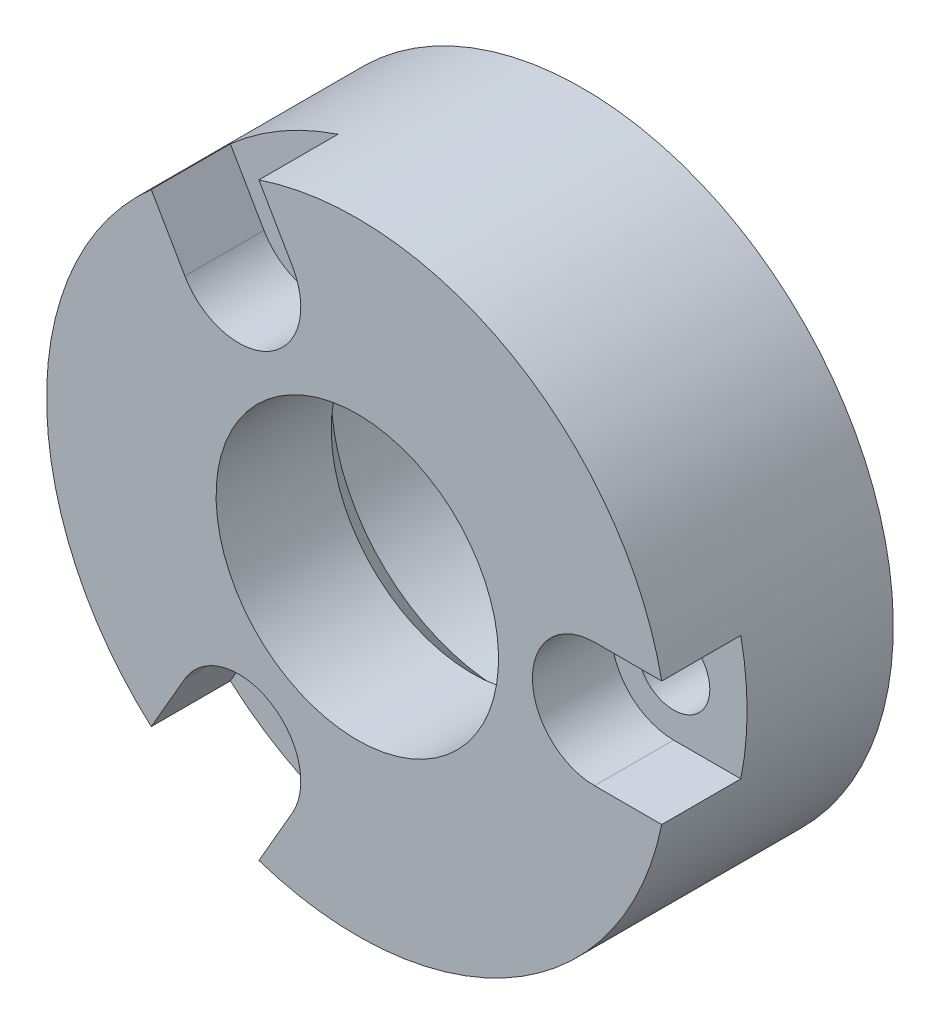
ISO-10303-21;
HEADER;
FILE_DESCRIPTION(('STEP AP214'),'2;1');
FILE_NAME('part.step','',(''),(''),'','','');
FILE_SCHEMA(('AUTOMOTIVE_DESIGN { 1 0 10303 214 1 1 1 1 }'));
ENDSEC;
DATA;
#1=APPLICATION_CONTEXT('core data for automotive mechanical design processes');
#2=APPLICATION_PROTOCOL_DEFINITION('international standard','automotive_design',2000,#1);
#3=PRODUCT_CONTEXT('',#1,'mechanical');
#4=PRODUCT('Part','Part','',(#3));
#5=PRODUCT_RELATED_PRODUCT_CATEGORY('part','',(#4));
#6=PRODUCT_DEFINITION_FORMATION('','',#4);
#7=PRODUCT_DEFINITION_CONTEXT('part definition',#1,'design');
#8=PRODUCT_DEFINITION('design','',#6,#7);
#9=PRODUCT_DEFINITION_SHAPE('','',#8);
#10=(LENGTH_UNIT() NAMED_UNIT(*) SI_UNIT(.MILLI.,.METRE.));
#11=(NAMED_UNIT(*) PLANE_ANGLE_UNIT() SI_UNIT($,.RADIAN.));
#12=(NAMED_UNIT(*) SI_UNIT($,.STERADIAN.) SOLID_ANGLE_UNIT());
#13=UNCERTAINTY_MEASURE_WITH_UNIT(LENGTH_MEASURE(1.E-05),#10,'distance_accuracy_value','');
#14=(GEOMETRIC_REPRESENTATION_CONTEXT(3) GLOBAL_UNCERTAINTY_ASSIGNED_CONTEXT((#13)) GLOBAL_UNIT_ASSIGNED_CONTEXT((#10,
#11,#12)) REPRESENTATION_CONTEXT('',''));
#15=CARTESIAN_POINT('',(0.,0.,0.));
#16=DIRECTION('',(0.,0.,1.));
#17=DIRECTION('',(1.,0.,0.));
#18=AXIS2_PLACEMENT_3D('',#15,#16,#17);
#19=CARTESIAN_POINT('',(0.,0.,40.));
#20=DIRECTION('',(0.,0.,1.));
#21=DIRECTION('',(0.499999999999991,0.866025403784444,0.));
#22=AXIS2_PLACEMENT_3D('',#19,#20,#21);
#23=CYLINDRICAL_SURFACE('',#22,27.5);
#24=CARTESIAN_POINT('',(0.,0.,19.94));
#25=DIRECTION('',(0.,0.,1.));
#26=DIRECTION('',(0.499999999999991,0.866025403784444,0.));
#27=AXIS2_PLACEMENT_3D('',#24,#25,#26);
#28=CIRCLE('',#27,27.5);
#29=CARTESIAN_POINT('',(-8.70905386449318,-26.0845237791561,19.94));
#30=VERTEX_POINT('',#29);
#31=CARTESIAN_POINT('',(26.944387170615,-5.5,19.94));
#32=VERTEX_POINT('',#31);
#33=EDGE_CURVE('E196',#30,#32,#28,.T.);
#34=ORIENTED_EDGE('',*,*,#33,.F.);
#35=DIRECTION('',(0.,0.,1.));
#36=VECTOR('',#35,1.);
#37=CARTESIAN_POINT('',(-8.70905386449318,-26.0845237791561,40.));
#38=LINE('',#37,#36);
#39=CARTESIAN_POINT('',(-8.70905386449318,-26.0845237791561,12.94));
#40=VERTEX_POINT('',#39);
#41=EDGE_CURVE('E135',#30,#40,#38,.F.);
#42=ORIENTED_EDGE('',*,*,#41,.T.);
#43=CARTESIAN_POINT('',(0.,0.,12.94));
#44=DIRECTION('',(0.,0.,1.));
#45=DIRECTION('',(1.,0.,0.));
#46=AXIS2_PLACEMENT_3D('',#43,#44,#45);
#47=CIRCLE('',#46,27.5);
#48=CARTESIAN_POINT('',(-18.235333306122,-20.584523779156,12.94));
#49=VERTEX_POINT('',#48);
#50=EDGE_CURVE('E9',#49,#40,#47,.T.);
#51=ORIENTED_EDGE('',*,*,#50,.F.);
#52=DIRECTION('',(0.,0.,1.));
#53=VECTOR('',#52,1.);
#54=CARTESIAN_POINT('',(-18.235333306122,-20.584523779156,40.));
#55=LINE('',#54,#53);
#56=CARTESIAN_POINT('',(-18.235333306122,-20.584523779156,19.94));
#57=VERTEX_POINT('',#56);
#58=EDGE_CURVE('E116',#49,#57,#55,.T.);
#59=ORIENTED_EDGE('',*,*,#58,.T.);
#60=CARTESIAN_POINT('',(-18.235333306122,20.584523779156,19.94));
#61=VERTEX_POINT('',#60);
#62=EDGE_CURVE('E201',#61,#57,#28,.T.);
#63=ORIENTED_EDGE('',*,*,#62,.F.);
#64=DIRECTION('',(0.,0.,1.));
#65=VECTOR('',#64,1.);
#66=CARTESIAN_POINT('',(-18.235333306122,20.584523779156,40.));
#67=LINE('',#66,#65);
#68=CARTESIAN_POINT('',(-18.235333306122,20.584523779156,12.94));
#69=VERTEX_POINT('',#68);
#70=EDGE_CURVE('E156',#61,#69,#67,.F.);
#71=ORIENTED_EDGE('',*,*,#70,.T.);
#72=CARTESIAN_POINT('',(0.,0.,12.94));
#73=DIRECTION('',(0.,0.,1.));
#74=DIRECTION('',(1.,0.,0.));
#75=AXIS2_PLACEMENT_3D('',#72,#73,#74);
#76=CIRCLE('',#75,27.5);
#77=CARTESIAN_POINT('',(-8.70905386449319,26.0845237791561,12.94));
#78=VERTEX_POINT('',#77);
#79=EDGE_CURVE('E212',#78,#69,#76,.T.);
#80=ORIENTED_EDGE('',*,*,#79,.F.);
#81=DIRECTION('',(0.,0.,1.));
#82=VECTOR('',#81,1.);
#83=CARTESIAN_POINT('',(-8.70905386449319,26.0845237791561,40.));
#84=LINE('',#83,#82);
#85=CARTESIAN_POINT('',(-8.70905386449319,26.0845237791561,19.94));
#86=VERTEX_POINT('',#85);
#87=EDGE_CURVE('E152',#78,#86,#84,.T.);
#88=ORIENTED_EDGE('',*,*,#87,.T.);
#89=CARTESIAN_POINT('',(26.944387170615,5.5,19.94));
#90=VERTEX_POINT('',#89);
#91=EDGE_CURVE('E197',#90,#86,#28,.T.);
#92=ORIENTED_EDGE('',*,*,#91,.F.);
#93=DIRECTION('',(0.,0.,1.));
#94=VECTOR('',#93,1.);
#95=CARTESIAN_POINT('',(26.944387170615,5.5,40.));
#96=LINE('',#95,#94);
#97=CARTESIAN_POINT('',(26.944387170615,5.5,12.94));
#98=VERTEX_POINT('',#97);
#99=EDGE_CURVE('E181',#90,#98,#96,.F.);
#100=ORIENTED_EDGE('',*,*,#99,.T.);
#101=CARTESIAN_POINT('',(0.,0.,12.94));
#102=DIRECTION('',(0.,0.,1.));
#103=DIRECTION('',(1.,0.,0.));
#104=AXIS2_PLACEMENT_3D('',#101,#102,#103);
#105=CIRCLE('',#104,27.5);
#106=CARTESIAN_POINT('',(26.944387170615,-5.5,12.94));
#107=VERTEX_POINT('',#106);
#108=EDGE_CURVE('E207',#107,#98,#105,.T.);
#109=ORIENTED_EDGE('',*,*,#108,.F.);
#110=DIRECTION('',(0.,0.,1.));
#111=VECTOR('',#110,1.);
#112=CARTESIAN_POINT('',(26.944387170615,-5.5,40.));
#113=LINE('',#112,#111);
#114=EDGE_CURVE('E176',#107,#32,#113,.T.);
#115=ORIENTED_EDGE('',*,*,#114,.T.);
#116=EDGE_LOOP('',(#34,#42,#51,#59,#63,#71,#80,#88,#92,#100,#109,#115));
#117=FACE_BOUND('',#116,.T.);
#118=CARTESIAN_POINT('',(0.,0.,0.));
#119=DIRECTION('',(0.,0.,1.));
#120=DIRECTION('',(0.499999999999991,0.866025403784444,0.));
#121=AXIS2_PLACEMENT_3D('',#118,#119,#120);
#122=CIRCLE('',#121,27.5);
#123=CARTESIAN_POINT('',(13.7499999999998,23.8156986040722,0.));
#124=VERTEX_POINT('',#123);
#125=EDGE_CURVE('E200',#124,#124,#122,.T.);
#126=ORIENTED_EDGE('',*,*,#125,.T.);
#127=EDGE_LOOP('',(#126));
#128=FACE_BOUND('',#127,.T.);
#129=ADVANCED_FACE('F14',(#117,#128),#23,.T.);
#130=CARTESIAN_POINT('',(-23.8156986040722,13.7499999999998,19.94));
#131=DIRECTION('',(0.,0.,-1.));
#132=DIRECTION('',(-0.499999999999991,-0.866025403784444,0.));
#133=AXIS2_PLACEMENT_3D('',#130,#131,#132);
#134=PLANE('',#133);
#135=CARTESIAN_POINT('',(-10.5,-18.1865334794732,19.94));
#136=DIRECTION('',(0.,0.,1.));
#137=DIRECTION('',(1.,0.,0.));
#138=AXIS2_PLACEMENT_3D('',#135,#136,#137);
#139=CIRCLE('',#138,5.5);
#140=CARTESIAN_POINT('',(-5.73686027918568,-20.9365334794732,19.94));
#141=VERTEX_POINT('',#140);
#142=CARTESIAN_POINT('',(-15.2631397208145,-15.4365334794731,19.94));
#143=VERTEX_POINT('',#142);
#144=EDGE_CURVE('E29',#141,#143,#139,.T.);
#145=ORIENTED_EDGE('',*,*,#144,.F.);
#146=DIRECTION('',(-0.5,-0.866025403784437,0.));
#147=VECTOR('',#146,1.);
#148=CARTESIAN_POINT('',(4.76313972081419,-2.75000000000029,19.94));
#149=LINE('',#148,#147);
#150=EDGE_CURVE('E22',#141,#30,#149,.T.);
#151=ORIENTED_EDGE('',*,*,#150,.T.);
#152=ORIENTED_EDGE('',*,*,#33,.T.);
#153=DIRECTION('',(1.,0.,0.));
#154=VECTOR('',#153,1.);
#155=CARTESIAN_POINT('',(39.8234844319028,-5.5,19.94));
#156=LINE('',#155,#154);
#157=CARTESIAN_POINT('',(21.,-5.5,19.94));
#158=VERTEX_POINT('',#157);
#159=EDGE_CURVE('E164',#158,#32,#156,.T.);
#160=ORIENTED_EDGE('',*,*,#159,.F.);
#161=CARTESIAN_POINT('',(21.,0.,19.94));
#162=DIRECTION('',(0.,0.,1.));
#163=DIRECTION('',(1.,0.,0.));
#164=AXIS2_PLACEMENT_3D('',#161,#162,#163);
#165=CIRCLE('',#164,5.5);
#166=CARTESIAN_POINT('',(21.,5.5,19.94));
#167=VERTEX_POINT('',#166);
#168=EDGE_CURVE('E159',#167,#158,#165,.T.);
#169=ORIENTED_EDGE('',*,*,#168,.F.);
#170=DIRECTION('',(1.,0.,0.));
#171=VECTOR('',#170,1.);
#172=CARTESIAN_POINT('',(-23.8156986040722,5.5,19.94));
#173=LINE('',#172,#171);
#174=EDGE_CURVE('E204',#167,#90,#173,.T.);
#175=ORIENTED_EDGE('',*,*,#174,.T.);
#176=ORIENTED_EDGE('',*,*,#91,.T.);
#177=DIRECTION('',(-0.5,0.866025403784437,0.));
#178=VECTOR('',#177,1.);
#179=CARTESIAN_POINT('',(-5.73686027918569,20.9365334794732,19.94));
#180=LINE('',#179,#178);
#181=CARTESIAN_POINT('',(-5.73686027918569,20.9365334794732,19.94));
#182=VERTEX_POINT('',#181);
#183=EDGE_CURVE('E142',#182,#86,#180,.T.);
#184=ORIENTED_EDGE('',*,*,#183,.F.);
#185=CARTESIAN_POINT('',(-10.5,18.1865334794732,19.94));
#186=DIRECTION('',(0.,0.,1.));
#187=DIRECTION('',(1.,0.,0.));
#188=AXIS2_PLACEMENT_3D('',#185,#186,#187);
#189=CIRCLE('',#188,5.5);
#190=CARTESIAN_POINT('',(-15.2631397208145,15.4365334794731,19.94));
#191=VERTEX_POINT('',#190);
#192=EDGE_CURVE('E37',#191,#182,#189,.T.);
#193=ORIENTED_EDGE('',*,*,#192,.F.);
#194=DIRECTION('',(-0.5,0.866025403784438,0.));
#195=VECTOR('',#194,1.);
#196=CARTESIAN_POINT('',(-16.6709890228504,17.875,19.94));
#197=LINE('',#196,#195);
#198=EDGE_CURVE('E209',#191,#61,#197,.T.);
#199=ORIENTED_EDGE('',*,*,#198,.T.);
#200=ORIENTED_EDGE('',*,*,#62,.T.);
#201=DIRECTION('',(-0.5,-0.866025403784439,0.));
#202=VECTOR('',#201,1.);
#203=CARTESIAN_POINT('',(-15.2631397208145,-15.4365334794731,19.94));
#204=LINE('',#203,#202);
#205=EDGE_CURVE('E123',#143,#57,#204,.T.);
#206=ORIENTED_EDGE('',*,*,#205,.F.);
#207=EDGE_LOOP('',(#145,#151,#152,#160,#169,#175,#176,#184,#193,#199,#200,#206));
#208=FACE_BOUND('',#207,.T.);
#209=CARTESIAN_POINT('',(0.,0.,19.94));
#210=DIRECTION('',(0.,0.,1.));
#211=DIRECTION('',(0.499999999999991,0.866025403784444,0.));
#212=AXIS2_PLACEMENT_3D('',#209,#210,#211);
#213=CIRCLE('',#212,12.5);
#214=CARTESIAN_POINT('',(6.24999999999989,10.8253175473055,19.94));
#215=VERTEX_POINT('',#214);
#216=EDGE_CURVE('E193',#215,#215,#213,.T.);
#217=ORIENTED_EDGE('',*,*,#216,.F.);
#218=EDGE_LOOP('',(#217));
#219=FACE_BOUND('',#218,.T.);
#220=ADVANCED_FACE('F216',(#208,#219),#134,.F.);
#221=CARTESIAN_POINT('',(-13.1635861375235,7.59999999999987,0.));
#222=DIRECTION('',(0.,0.,1.));
#223=DIRECTION('',(0.499999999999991,0.866025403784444,0.));
#224=AXIS2_PLACEMENT_3D('',#221,#222,#223);
#225=PLANE('',#224);
#226=CARTESIAN_POINT('',(-10.5,18.1865334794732,0.));
#227=DIRECTION('',(0.,0.,1.));
#228=DIRECTION('',(1.,0.,0.));
#229=AXIS2_PLACEMENT_3D('',#226,#227,#228);
#230=CIRCLE('',#229,3.2);
#231=CARTESIAN_POINT('',(-7.3,18.1865334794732,0.));
#232=VERTEX_POINT('',#231);
#233=EDGE_CURVE('E310',#232,#232,#230,.T.);
#234=ORIENTED_EDGE('',*,*,#233,.T.);
#235=EDGE_LOOP('',(#234));
#236=FACE_BOUND('',#235,.T.);
#237=CARTESIAN_POINT('',(-10.5,-18.1865334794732,0.));
#238=DIRECTION('',(0.,0.,1.));
#239=DIRECTION('',(1.,0.,0.));
#240=AXIS2_PLACEMENT_3D('',#237,#238,#239);
#241=CIRCLE('',#240,3.2);
#242=CARTESIAN_POINT('',(-7.3,-18.1865334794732,0.));
#243=VERTEX_POINT('',#242);
#244=EDGE_CURVE('E318',#243,#243,#241,.T.);
#245=ORIENTED_EDGE('',*,*,#244,.T.);
#246=EDGE_LOOP('',(#245));
#247=FACE_BOUND('',#246,.T.);
#248=CARTESIAN_POINT('',(21.,0.,0.));
#249=DIRECTION('',(0.,0.,1.));
#250=DIRECTION('',(1.,0.,0.));
#251=AXIS2_PLACEMENT_3D('',#248,#249,#250);
#252=CIRCLE('',#251,3.2);
#253=CARTESIAN_POINT('',(24.2,0.,0.));
#254=VERTEX_POINT('',#253);
#255=EDGE_CURVE('E131',#254,#254,#252,.T.);
#256=ORIENTED_EDGE('',*,*,#255,.T.);
#257=EDGE_LOOP('',(#256));
#258=FACE_BOUND('',#257,.T.);
#259=ORIENTED_EDGE('',*,*,#125,.F.);
#260=EDGE_LOOP('',(#259));
#261=FACE_BOUND('',#260,.T.);
#262=CARTESIAN_POINT('',(0.,0.,0.));
#263=DIRECTION('',(0.,0.,1.));
#264=DIRECTION('',(0.499999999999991,0.866025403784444,0.));
#265=AXIS2_PLACEMENT_3D('',#262,#263,#264);
#266=CIRCLE('',#265,15.2);
#267=CARTESIAN_POINT('',(7.59999999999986,13.1635861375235,0.));
#268=VERTEX_POINT('',#267);
#269=EDGE_CURVE('E184',#268,#268,#266,.T.);
#270=ORIENTED_EDGE('',*,*,#269,.T.);
#271=EDGE_LOOP('',(#270));
#272=FACE_BOUND('',#271,.T.);
#273=ADVANCED_FACE('F16',(#236,#247,#258,#261,#272),#225,.F.);
#274=CARTESIAN_POINT('',(0.,0.,40.));
#275=DIRECTION('',(0.,0.,1.));
#276=DIRECTION('',(0.499999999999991,0.866025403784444,0.));
#277=AXIS2_PLACEMENT_3D('',#274,#275,#276);
#278=CYLINDRICAL_SURFACE('',#277,12.5);
#279=CARTESIAN_POINT('',(0.,0.,9.75));
#280=DIRECTION('',(0.,0.,1.));
#281=DIRECTION('',(0.499999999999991,0.866025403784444,0.));
#282=AXIS2_PLACEMENT_3D('',#279,#280,#281);
#283=CIRCLE('',#282,12.5);
#284=CARTESIAN_POINT('',(6.24999999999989,10.8253175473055,9.75));
#285=VERTEX_POINT('',#284);
#286=EDGE_CURVE('E190',#285,#285,#283,.T.);
#287=ORIENTED_EDGE('',*,*,#286,.F.);
#288=EDGE_LOOP('',(#287));
#289=FACE_BOUND('',#288,.T.);
#290=ORIENTED_EDGE('',*,*,#216,.T.);
#291=EDGE_LOOP('',(#290));
#292=FACE_BOUND('',#291,.T.);
#293=ADVANCED_FACE('F244',(#289,#292),#278,.F.);
#294=CARTESIAN_POINT('',(0.,0.,9.75));
#295=DIRECTION('',(0.,0.,-1.));
#296=DIRECTION('',(-0.499999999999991,-0.866025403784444,0.));
#297=AXIS2_PLACEMENT_3D('',#294,#295,#296);
#298=CONICAL_SURFACE('',#297,12.5,0.785398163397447);
#299=CARTESIAN_POINT('',(0.,0.,7.05));
#300=DIRECTION('',(0.,0.,1.));
#301=DIRECTION('',(0.499999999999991,0.866025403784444,0.));
#302=AXIS2_PLACEMENT_3D('',#299,#300,#301);
#303=CIRCLE('',#302,15.2);
#304=CARTESIAN_POINT('',(7.59999999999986,13.1635861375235,7.05));
#305=VERTEX_POINT('',#304);
#306=EDGE_CURVE('E187',#305,#305,#303,.T.);
#307=ORIENTED_EDGE('',*,*,#306,.F.);
#308=EDGE_LOOP('',(#307));
#309=FACE_BOUND('',#308,.T.);
#310=ORIENTED_EDGE('',*,*,#286,.T.);
#311=EDGE_LOOP('',(#310));
#312=FACE_BOUND('',#311,.T.);
#313=ADVANCED_FACE('F247',(#309,#312),#298,.F.);
#314=CARTESIAN_POINT('',(0.,0.,40.));
#315=DIRECTION('',(0.,0.,1.));
#316=DIRECTION('',(0.499999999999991,0.866025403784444,0.));
#317=AXIS2_PLACEMENT_3D('',#314,#315,#316);
#318=CYLINDRICAL_SURFACE('',#317,15.2);
#319=ORIENTED_EDGE('',*,*,#269,.F.);
#320=EDGE_LOOP('',(#319));
#321=FACE_BOUND('',#320,.T.);
#322=ORIENTED_EDGE('',*,*,#306,.T.);
#323=EDGE_LOOP('',(#322));
#324=FACE_BOUND('',#323,.T.);
#325=ADVANCED_FACE('F251',(#321,#324),#318,.F.);
#326=CARTESIAN_POINT('',(21.,0.,12.94));
#327=DIRECTION('',(0.,0.,1.));
#328=DIRECTION('',(1.,0.,0.));
#329=AXIS2_PLACEMENT_3D('',#326,#327,#328);
#330=PLANE('',#329);
#331=CARTESIAN_POINT('',(21.,0.,12.94));
#332=DIRECTION('',(0.,0.,1.));
#333=DIRECTION('',(1.,0.,0.));
#334=AXIS2_PLACEMENT_3D('',#331,#332,#333);
#335=CIRCLE('',#334,3.2);
#336=CARTESIAN_POINT('',(24.2,0.,12.94));
#337=VERTEX_POINT('',#336);
#338=EDGE_CURVE('E127',#337,#337,#335,.T.);
#339=ORIENTED_EDGE('',*,*,#338,.F.);
#340=EDGE_LOOP('',(#339));
#341=FACE_BOUND('',#340,.T.);
#342=ORIENTED_EDGE('',*,*,#108,.T.);
#343=DIRECTION('',(-1.,0.,0.));
#344=VECTOR('',#343,1.);
#345=CARTESIAN_POINT('',(21.,5.5,12.94));
#346=LINE('',#345,#344);
#347=CARTESIAN_POINT('',(21.,5.5,12.94));
#348=VERTEX_POINT('',#347);
#349=EDGE_CURVE('E167',#98,#348,#346,.T.);
#350=ORIENTED_EDGE('',*,*,#349,.T.);
#351=CARTESIAN_POINT('',(21.,0.,12.94));
#352=DIRECTION('',(0.,0.,1.));
#353=DIRECTION('',(1.,0.,0.));
#354=AXIS2_PLACEMENT_3D('',#351,#352,#353);
#355=CIRCLE('',#354,5.5);
#356=CARTESIAN_POINT('',(21.,-5.5,12.94));
#357=VERTEX_POINT('',#356);
#358=EDGE_CURVE('E160',#348,#357,#355,.T.);
#359=ORIENTED_EDGE('',*,*,#358,.T.);
#360=DIRECTION('',(1.,0.,0.));
#361=VECTOR('',#360,1.);
#362=CARTESIAN_POINT('',(39.8234844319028,-5.5,12.94));
#363=LINE('',#362,#361);
#364=EDGE_CURVE('E163',#357,#107,#363,.T.);
#365=ORIENTED_EDGE('',*,*,#364,.T.);
#366=EDGE_LOOP('',(#342,#350,#359,#365));
#367=FACE_BOUND('',#366,.T.);
#368=ADVANCED_FACE('F255',(#341,#367),#330,.T.);
#369=CARTESIAN_POINT('',(21.,5.5,12.94));
#370=DIRECTION('',(0.,1.,0.));
#371=DIRECTION('',(0.,0.,1.));
#372=AXIS2_PLACEMENT_3D('',#369,#370,#371);
#373=PLANE('',#372);
#374=ORIENTED_EDGE('',*,*,#174,.F.);
#375=DIRECTION('',(0.,0.,1.));
#376=VECTOR('',#375,1.);
#377=CARTESIAN_POINT('',(21.,5.5,12.94));
#378=LINE('',#377,#376);
#379=EDGE_CURVE('E173',#348,#167,#378,.T.);
#380=ORIENTED_EDGE('',*,*,#379,.F.);
#381=ORIENTED_EDGE('',*,*,#349,.F.);
#382=ORIENTED_EDGE('',*,*,#99,.F.);
#383=EDGE_LOOP('',(#374,#380,#381,#382));
#384=FACE_BOUND('',#383,.T.);
#385=ADVANCED_FACE('F265',(#384),#373,.F.);
#386=CARTESIAN_POINT('',(39.8234844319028,-5.5,12.94));
#387=DIRECTION('',(0.,-1.,0.));
#388=DIRECTION('',(0.,0.,-1.));
#389=AXIS2_PLACEMENT_3D('',#386,#387,#388);
#390=PLANE('',#389);
#391=ORIENTED_EDGE('',*,*,#364,.F.);
#392=DIRECTION('',(0.,0.,1.));
#393=VECTOR('',#392,1.);
#394=CARTESIAN_POINT('',(21.,-5.5,12.94));
#395=LINE('',#394,#393);
#396=EDGE_CURVE('E169',#357,#158,#395,.T.);
#397=ORIENTED_EDGE('',*,*,#396,.T.);
#398=ORIENTED_EDGE('',*,*,#159,.T.);
#399=ORIENTED_EDGE('',*,*,#114,.F.);
#400=EDGE_LOOP('',(#391,#397,#398,#399));
#401=FACE_BOUND('',#400,.T.);
#402=ADVANCED_FACE('F261',(#401),#390,.F.);
#403=CARTESIAN_POINT('',(21.,0.,12.94));
#404=DIRECTION('',(0.,0.,1.));
#405=DIRECTION('',(1.,0.,0.));
#406=AXIS2_PLACEMENT_3D('',#403,#404,#405);
#407=CYLINDRICAL_SURFACE('',#406,5.5);
#408=ORIENTED_EDGE('',*,*,#168,.T.);
#409=ORIENTED_EDGE('',*,*,#396,.F.);
#410=ORIENTED_EDGE('',*,*,#358,.F.);
#411=ORIENTED_EDGE('',*,*,#379,.T.);
#412=EDGE_LOOP('',(#408,#409,#410,#411));
#413=FACE_BOUND('',#412,.T.);
#414=ADVANCED_FACE('F257',(#413),#407,.F.);
#415=CARTESIAN_POINT('',(-10.5,18.1865334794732,12.94));
#416=DIRECTION('',(0.,0.,1.));
#417=DIRECTION('',(1.,0.,0.));
#418=AXIS2_PLACEMENT_3D('',#415,#416,#417);
#419=PLANE('',#418);
#420=CARTESIAN_POINT('',(-10.5,18.1865334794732,12.94));
#421=DIRECTION('',(0.,0.,1.));
#422=DIRECTION('',(1.,0.,0.));
#423=AXIS2_PLACEMENT_3D('',#420,#421,#422);
#424=CIRCLE('',#423,3.2);
#425=CARTESIAN_POINT('',(-7.3,18.1865334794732,12.94));
#426=VERTEX_POINT('',#425);
#427=EDGE_CURVE('E313',#426,#426,#424,.T.);
#428=ORIENTED_EDGE('',*,*,#427,.F.);
#429=EDGE_LOOP('',(#428));
#430=FACE_BOUND('',#429,.T.);
#431=ORIENTED_EDGE('',*,*,#79,.T.);
#432=DIRECTION('',(0.5,-0.866025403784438,0.));
#433=VECTOR('',#432,1.);
#434=CARTESIAN_POINT('',(-15.2631397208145,15.4365334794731,12.94));
#435=LINE('',#434,#433);
#436=CARTESIAN_POINT('',(-15.2631397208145,15.4365334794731,12.94));
#437=VERTEX_POINT('',#436);
#438=EDGE_CURVE('E145',#69,#437,#435,.T.);
#439=ORIENTED_EDGE('',*,*,#438,.T.);
#440=CARTESIAN_POINT('',(-10.5,18.1865334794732,12.94));
#441=DIRECTION('',(0.,0.,1.));
#442=DIRECTION('',(1.,0.,0.));
#443=AXIS2_PLACEMENT_3D('',#440,#441,#442);
#444=CIRCLE('',#443,5.5);
#445=CARTESIAN_POINT('',(-5.73686027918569,20.9365334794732,12.94));
#446=VERTEX_POINT('',#445);
#447=EDGE_CURVE('E138',#437,#446,#444,.T.);
#448=ORIENTED_EDGE('',*,*,#447,.T.);
#449=DIRECTION('',(-0.5,0.866025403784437,0.));
#450=VECTOR('',#449,1.);
#451=CARTESIAN_POINT('',(-5.73686027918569,20.9365334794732,12.94));
#452=LINE('',#451,#450);
#453=EDGE_CURVE('E141',#446,#78,#452,.T.);
#454=ORIENTED_EDGE('',*,*,#453,.T.);
#455=EDGE_LOOP('',(#431,#439,#448,#454));
#456=FACE_BOUND('',#455,.T.);
#457=ADVANCED_FACE('F260',(#430,#456),#419,.T.);
#458=CARTESIAN_POINT('',(-15.2631397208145,15.4365334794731,12.94));
#459=DIRECTION('',(-0.866025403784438,-0.5,0.));
#460=DIRECTION('',(0.5,-0.866025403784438,0.));
#461=AXIS2_PLACEMENT_3D('',#458,#459,#460);
#462=PLANE('',#461);
#463=ORIENTED_EDGE('',*,*,#198,.F.);
#464=DIRECTION('',(0.,0.,1.));
#465=VECTOR('',#464,1.);
#466=CARTESIAN_POINT('',(-15.2631397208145,15.4365334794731,12.94));
#467=LINE('',#466,#465);
#468=EDGE_CURVE('E150',#437,#191,#467,.T.);
#469=ORIENTED_EDGE('',*,*,#468,.F.);
#470=ORIENTED_EDGE('',*,*,#438,.F.);
#471=ORIENTED_EDGE('',*,*,#70,.F.);
#472=EDGE_LOOP('',(#463,#469,#470,#471));
#473=FACE_BOUND('',#472,.T.);
#474=ADVANCED_FACE('F278',(#473),#462,.F.);
#475=CARTESIAN_POINT('',(-5.73686027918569,20.9365334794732,12.94));
#476=DIRECTION('',(0.866025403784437,0.5,0.));
#477=DIRECTION('',(-0.5,0.866025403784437,0.));
#478=AXIS2_PLACEMENT_3D('',#475,#476,#477);
#479=PLANE('',#478);
#480=ORIENTED_EDGE('',*,*,#453,.F.);
#481=DIRECTION('',(0.,0.,1.));
#482=VECTOR('',#481,1.);
#483=CARTESIAN_POINT('',(-5.73686027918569,20.9365334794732,12.94));
#484=LINE('',#483,#482);
#485=EDGE_CURVE('E147',#446,#182,#484,.T.);
#486=ORIENTED_EDGE('',*,*,#485,.T.);
#487=ORIENTED_EDGE('',*,*,#183,.T.);
#488=ORIENTED_EDGE('',*,*,#87,.F.);
#489=EDGE_LOOP('',(#480,#486,#487,#488));
#490=FACE_BOUND('',#489,.T.);
#491=ADVANCED_FACE('F275',(#490),#479,.F.);
#492=CARTESIAN_POINT('',(-10.5,18.1865334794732,12.94));
#493=DIRECTION('',(0.,0.,1.));
#494=DIRECTION('',(1.,0.,0.));
#495=AXIS2_PLACEMENT_3D('',#492,#493,#494);
#496=CYLINDRICAL_SURFACE('',#495,5.5);
#497=ORIENTED_EDGE('',*,*,#192,.T.);
#498=ORIENTED_EDGE('',*,*,#485,.F.);
#499=ORIENTED_EDGE('',*,*,#447,.F.);
#500=ORIENTED_EDGE('',*,*,#468,.T.);
#501=EDGE_LOOP('',(#497,#498,#499,#500));
#502=FACE_BOUND('',#501,.T.);
#503=ADVANCED_FACE('F235',(#502),#496,.F.);
#504=CARTESIAN_POINT('',(-10.5,-18.1865334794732,12.94));
#505=DIRECTION('',(0.,0.,1.));
#506=DIRECTION('',(1.,0.,0.));
#507=AXIS2_PLACEMENT_3D('',#504,#505,#506);
#508=PLANE('',#507);
#509=CARTESIAN_POINT('',(-10.5,-18.1865334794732,12.94));
#510=DIRECTION('',(0.,0.,1.));
#511=DIRECTION('',(1.,0.,0.));
#512=AXIS2_PLACEMENT_3D('',#509,#510,#511);
#513=CIRCLE('',#512,3.2);
#514=CARTESIAN_POINT('',(-7.3,-18.1865334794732,12.94));
#515=VERTEX_POINT('',#514);
#516=EDGE_CURVE('E315',#515,#515,#513,.T.);
#517=ORIENTED_EDGE('',*,*,#516,.F.);
#518=EDGE_LOOP('',(#517));
#519=FACE_BOUND('',#518,.T.);
#520=ORIENTED_EDGE('',*,*,#50,.T.);
#521=DIRECTION('',(0.5,0.866025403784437,0.));
#522=VECTOR('',#521,1.);
#523=CARTESIAN_POINT('',(-5.73686027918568,-20.9365334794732,12.94));
#524=LINE('',#523,#522);
#525=CARTESIAN_POINT('',(-5.73686027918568,-20.9365334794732,12.94));
#526=VERTEX_POINT('',#525);
#527=EDGE_CURVE('E110',#40,#526,#524,.T.);
#528=ORIENTED_EDGE('',*,*,#527,.T.);
#529=CARTESIAN_POINT('',(-10.5,-18.1865334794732,12.94));
#530=DIRECTION('',(0.,0.,1.));
#531=DIRECTION('',(1.,0.,0.));
#532=AXIS2_PLACEMENT_3D('',#529,#530,#531);
#533=CIRCLE('',#532,5.5);
#534=CARTESIAN_POINT('',(-15.2631397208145,-15.4365334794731,12.94));
#535=VERTEX_POINT('',#534);
#536=EDGE_CURVE('E106',#526,#535,#533,.T.);
#537=ORIENTED_EDGE('',*,*,#536,.T.);
#538=DIRECTION('',(-0.5,-0.866025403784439,0.));
#539=VECTOR('',#538,1.);
#540=CARTESIAN_POINT('',(-15.2631397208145,-15.4365334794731,12.94));
#541=LINE('',#540,#539);
#542=EDGE_CURVE('E113',#535,#49,#541,.T.);
#543=ORIENTED_EDGE('',*,*,#542,.T.);
#544=EDGE_LOOP('',(#520,#528,#537,#543));
#545=FACE_BOUND('',#544,.T.);
#546=ADVANCED_FACE('F120',(#519,#545),#508,.T.);
#547=CARTESIAN_POINT('',(-5.73686027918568,-20.9365334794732,12.94));
#548=DIRECTION('',(0.866025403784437,-0.5,0.));
#549=DIRECTION('',(0.5,0.866025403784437,0.));
#550=AXIS2_PLACEMENT_3D('',#547,#548,#549);
#551=PLANE('',#550);
#552=ORIENTED_EDGE('',*,*,#150,.F.);
#553=DIRECTION('',(0.,0.,1.));
#554=VECTOR('',#553,1.);
#555=CARTESIAN_POINT('',(-5.73686027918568,-20.9365334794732,12.94));
#556=LINE('',#555,#554);
#557=EDGE_CURVE('E109',#526,#141,#556,.T.);
#558=ORIENTED_EDGE('',*,*,#557,.F.);
#559=ORIENTED_EDGE('',*,*,#527,.F.);
#560=ORIENTED_EDGE('',*,*,#41,.F.);
#561=EDGE_LOOP('',(#552,#558,#559,#560));
#562=FACE_BOUND('',#561,.T.);
#563=ADVANCED_FACE('F226',(#562),#551,.F.);
#564=CARTESIAN_POINT('',(-15.2631397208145,-15.4365334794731,12.94));
#565=DIRECTION('',(-0.866025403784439,0.5,0.));
#566=DIRECTION('',(-0.5,-0.866025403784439,0.));
#567=AXIS2_PLACEMENT_3D('',#564,#565,#566);
#568=PLANE('',#567);
#569=ORIENTED_EDGE('',*,*,#542,.F.);
#570=DIRECTION('',(0.,0.,1.));
#571=VECTOR('',#570,1.);
#572=CARTESIAN_POINT('',(-15.2631397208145,-15.4365334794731,12.94));
#573=LINE('',#572,#571);
#574=EDGE_CURVE('E102',#535,#143,#573,.T.);
#575=ORIENTED_EDGE('',*,*,#574,.T.);
#576=ORIENTED_EDGE('',*,*,#205,.T.);
#577=ORIENTED_EDGE('',*,*,#58,.F.);
#578=EDGE_LOOP('',(#569,#575,#576,#577));
#579=FACE_BOUND('',#578,.T.);
#580=ADVANCED_FACE('F114',(#579),#568,.F.);
#581=CARTESIAN_POINT('',(-10.5,-18.1865334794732,12.94));
#582=DIRECTION('',(0.,0.,1.));
#583=DIRECTION('',(1.,0.,0.));
#584=AXIS2_PLACEMENT_3D('',#581,#582,#583);
#585=CYLINDRICAL_SURFACE('',#584,5.5);
#586=ORIENTED_EDGE('',*,*,#144,.T.);
#587=ORIENTED_EDGE('',*,*,#574,.F.);
#588=ORIENTED_EDGE('',*,*,#536,.F.);
#589=ORIENTED_EDGE('',*,*,#557,.T.);
#590=EDGE_LOOP('',(#586,#587,#588,#589));
#591=FACE_BOUND('',#590,.T.);
#592=ADVANCED_FACE('F104',(#591),#585,.F.);
#593=CARTESIAN_POINT('',(21.,0.,0.));
#594=DIRECTION('',(0.,0.,1.));
#595=DIRECTION('',(1.,0.,0.));
#596=AXIS2_PLACEMENT_3D('',#593,#594,#595);
#597=CYLINDRICAL_SURFACE('',#596,3.2);
#598=ORIENTED_EDGE('',*,*,#255,.F.);
#599=EDGE_LOOP('',(#598));
#600=FACE_BOUND('',#599,.T.);
#601=ORIENTED_EDGE('',*,*,#338,.T.);
#602=EDGE_LOOP('',(#601));
#603=FACE_BOUND('',#602,.T.);
#604=ADVANCED_FACE('F287',(#600,#603),#597,.F.);
#605=CARTESIAN_POINT('',(-10.5,-18.1865334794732,0.));
#606=DIRECTION('',(0.,0.,1.));
#607=DIRECTION('',(1.,0.,0.));
#608=AXIS2_PLACEMENT_3D('',#605,#606,#607);
#609=CYLINDRICAL_SURFACE('',#608,3.2);
#610=ORIENTED_EDGE('',*,*,#244,.F.);
#611=EDGE_LOOP('',(#610));
#612=FACE_BOUND('',#611,.T.);
#613=ORIENTED_EDGE('',*,*,#516,.T.);
#614=EDGE_LOOP('',(#613));
#615=FACE_BOUND('',#614,.T.);
#616=ADVANCED_FACE('F291',(#612,#615),#609,.F.);
#617=CARTESIAN_POINT('',(-10.5,18.1865334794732,0.));
#618=DIRECTION('',(0.,0.,1.));
#619=DIRECTION('',(1.,0.,0.));
#620=AXIS2_PLACEMENT_3D('',#617,#618,#619);
#621=CYLINDRICAL_SURFACE('',#620,3.2);
#622=ORIENTED_EDGE('',*,*,#233,.F.);
#623=EDGE_LOOP('',(#622));
#624=FACE_BOUND('',#623,.T.);
#625=ORIENTED_EDGE('',*,*,#427,.T.);
#626=EDGE_LOOP('',(#625));
#627=FACE_BOUND('',#626,.T.);
#628=ADVANCED_FACE('F297',(#624,#627),#621,.F.);
#629=CLOSED_SHELL('',(#129,#220,#273,#293,#313,#325,#368,#385,#402,#414,#457,#474,#491,#503,
#546,#563,#580,#592,#604,#616,#628));
#630=MANIFOLD_SOLID_BREP('B1',#629);
#631=ADVANCED_BREP_SHAPE_REPRESENTATION('',(#18,#630),#14);
#632=SHAPE_DEFINITION_REPRESENTATION(#9,#631);
ENDSEC;
END-ISO-10303-21;
